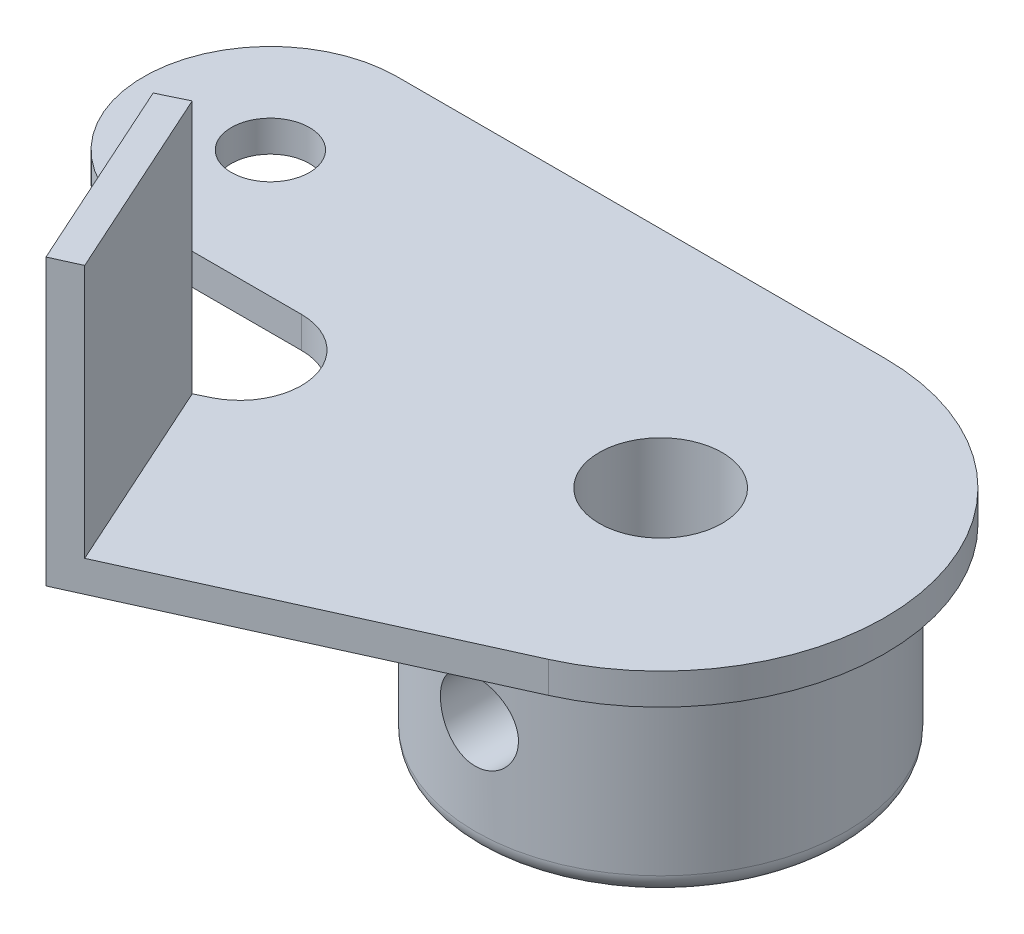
ISO-10303-21;
HEADER;
FILE_DESCRIPTION(('STEP AP214'),'2;1');
FILE_NAME('part.step','',(''),(''),'','','');
FILE_SCHEMA(('AUTOMOTIVE_DESIGN { 1 0 10303 214 1 1 1 1 }'));
ENDSEC;
DATA;
#1=APPLICATION_CONTEXT('core data for automotive mechanical design processes');
#2=APPLICATION_PROTOCOL_DEFINITION('international standard','automotive_design',2000,#1);
#3=PRODUCT_CONTEXT('',#1,'mechanical');
#4=PRODUCT('Part','Part','',(#3));
#5=PRODUCT_RELATED_PRODUCT_CATEGORY('part','',(#4));
#6=PRODUCT_DEFINITION_FORMATION('','',#4);
#7=PRODUCT_DEFINITION_CONTEXT('part definition',#1,'design');
#8=PRODUCT_DEFINITION('design','',#6,#7);
#9=PRODUCT_DEFINITION_SHAPE('','',#8);
#10=(LENGTH_UNIT() NAMED_UNIT(*) SI_UNIT(.MILLI.,.METRE.));
#11=(NAMED_UNIT(*) PLANE_ANGLE_UNIT() SI_UNIT($,.RADIAN.));
#12=(NAMED_UNIT(*) SI_UNIT($,.STERADIAN.) SOLID_ANGLE_UNIT());
#13=UNCERTAINTY_MEASURE_WITH_UNIT(LENGTH_MEASURE(1.E-05),#10,'distance_accuracy_value','');
#14=(GEOMETRIC_REPRESENTATION_CONTEXT(3) GLOBAL_UNCERTAINTY_ASSIGNED_CONTEXT((#13)) GLOBAL_UNIT_ASSIGNED_CONTEXT((#10,
#11,#12)) REPRESENTATION_CONTEXT('',''));
#15=CARTESIAN_POINT('',(0.,0.,0.));
#16=DIRECTION('',(0.,0.,1.));
#17=DIRECTION('',(1.,0.,0.));
#18=AXIS2_PLACEMENT_3D('',#15,#16,#17);
#19=CARTESIAN_POINT('',(0.,1.6,0.));
#20=DIRECTION('',(0.,-1.,0.));
#21=DIRECTION('',(0.,0.,-1.));
#22=AXIS2_PLACEMENT_3D('',#19,#20,#21);
#23=CYLINDRICAL_SURFACE('',#22,3.15);
#24=CARTESIAN_POINT('',(0.,-9.9,0.));
#25=DIRECTION('',(0.,1.,0.));
#26=DIRECTION('',(0.,0.,1.));
#27=AXIS2_PLACEMENT_3D('',#24,#25,#26);
#28=CIRCLE('',#27,3.15);
#29=CARTESIAN_POINT('',(0.,-9.9,3.15));
#30=VERTEX_POINT('',#29);
#31=EDGE_CURVE('E162',#30,#30,#28,.T.);
#32=ORIENTED_EDGE('',*,*,#31,.F.);
#33=EDGE_LOOP('',(#32));
#34=FACE_BOUND('',#33,.T.);
#35=CARTESIAN_POINT('',(0.,1.6,0.));
#36=DIRECTION('',(0.,1.,0.));
#37=DIRECTION('',(0.,0.,1.));
#38=AXIS2_PLACEMENT_3D('',#35,#36,#37);
#39=CIRCLE('',#38,3.15);
#40=CARTESIAN_POINT('',(0.,1.6,3.15));
#41=VERTEX_POINT('',#40);
#42=EDGE_CURVE('E170',#41,#41,#39,.T.);
#43=ORIENTED_EDGE('',*,*,#42,.T.);
#44=EDGE_LOOP('',(#43));
#45=FACE_BOUND('',#44,.T.);
#46=CARTESIAN_POINT('',(-2.,-4.,2.43361870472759));
#47=CARTESIAN_POINT('',(-1.99999048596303,-4.09897792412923,2.43363407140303));
#48=CARTESIAN_POINT('',(-1.99258494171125,-4.1980937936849,2.4397712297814));
#49=CARTESIAN_POINT('',(-1.96350941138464,-4.39293729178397,2.46321942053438));
#50=CARTESIAN_POINT('',(-1.94180331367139,-4.48865569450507,2.48055873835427));
#51=CARTESIAN_POINT('',(-1.88571217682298,-4.67329343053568,2.52345220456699));
#52=CARTESIAN_POINT('',(-1.851440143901,-4.76226508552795,2.5489328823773));
#53=CARTESIAN_POINT('',(-1.77151743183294,-4.93307511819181,2.60511197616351));
#54=CARTESIAN_POINT('',(-1.72586583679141,-5.01491292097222,2.6358108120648));
#55=CARTESIAN_POINT('',(-1.61708994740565,-5.18163300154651,2.70410628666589));
#56=CARTESIAN_POINT('',(-1.55241882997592,-5.26535664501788,2.74206853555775));
#57=CARTESIAN_POINT('',(-1.41059220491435,-5.42175437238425,2.81765858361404));
#58=CARTESIAN_POINT('',(-1.33342569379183,-5.49441860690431,2.85528605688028));
#59=CARTESIAN_POINT('',(-1.15704034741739,-5.63571807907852,2.93157022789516));
#60=CARTESIAN_POINT('',(-1.05626802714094,-5.70269215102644,2.96975927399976));
#61=CARTESIAN_POINT('',(-0.841996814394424,-5.81818709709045,3.03745228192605));
#62=CARTESIAN_POINT('',(-0.728511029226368,-5.86672675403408,3.0669650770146));
#63=CARTESIAN_POINT('',(-0.504499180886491,-5.9385134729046,3.11120961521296));
#64=CARTESIAN_POINT('',(-0.394895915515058,-5.96386827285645,3.12716069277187));
#65=CARTESIAN_POINT('',(-0.171964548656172,-5.99576167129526,3.14728504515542));
#66=CARTESIAN_POINT('',(-0.0586406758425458,-6.00232093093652,3.15147125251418));
#67=CARTESIAN_POINT('',(0.151552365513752,-5.99662936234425,3.1478620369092));
#68=CARTESIAN_POINT('',(0.248528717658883,-5.98685561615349,3.14164430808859));
#69=CARTESIAN_POINT('',(0.439138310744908,-5.95359030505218,3.12071260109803));
#70=CARTESIAN_POINT('',(0.532771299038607,-5.93009770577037,3.10599798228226));
#71=CARTESIAN_POINT('',(0.71448221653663,-5.87047576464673,3.06930433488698));
#72=CARTESIAN_POINT('',(0.802553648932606,-5.83433195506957,3.04731699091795));
#73=CARTESIAN_POINT('',(0.971433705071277,-5.75077179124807,2.9977610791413));
#74=CARTESIAN_POINT('',(1.05224075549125,-5.70335300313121,2.97019130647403));
#75=CARTESIAN_POINT('',(1.21525026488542,-5.5918894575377,2.90761365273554));
#76=CARTESIAN_POINT('',(1.29634063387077,-5.52650141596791,2.87210613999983));
#77=CARTESIAN_POINT('',(1.44710869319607,-5.3844238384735,2.79917994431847));
#78=CARTESIAN_POINT('',(1.51676911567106,-5.3077175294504,2.76175847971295));
#79=CARTESIAN_POINT('',(1.65238450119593,-5.13291104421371,2.68310715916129));
#80=CARTESIAN_POINT('',(1.71653615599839,-5.03331982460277,2.64205458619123));
#81=CARTESIAN_POINT('',(1.82699006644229,-4.82232618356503,2.56692053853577));
#82=CARTESIAN_POINT('',(1.87332485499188,-4.71094576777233,2.53282641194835));
#83=CARTESIAN_POINT('',(1.93594353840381,-4.50993207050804,2.48510313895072));
#84=CARTESIAN_POINT('',(1.95695691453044,-4.4224981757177,2.4684365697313));
#85=CARTESIAN_POINT('',(1.98705521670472,-4.24441139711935,2.44427838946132));
#86=CARTESIAN_POINT('',(1.99615746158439,-4.15376338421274,2.43677345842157));
#87=CARTESIAN_POINT('',(2.00187916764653,-3.97154888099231,2.43207683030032));
#88=CARTESIAN_POINT('',(1.99846473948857,-3.87998056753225,2.43491313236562));
#89=CARTESIAN_POINT('',(1.97931399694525,-3.69897745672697,2.45050151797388));
#90=CARTESIAN_POINT('',(1.96356738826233,-3.60954450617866,2.46326188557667));
#91=CARTESIAN_POINT('',(1.92117762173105,-3.43716644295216,2.4964515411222));
#92=CARTESIAN_POINT('',(1.89479801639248,-3.35411849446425,2.51669442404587));
#93=CARTESIAN_POINT('',(1.83219474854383,-3.19346113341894,2.56262885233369));
#94=CARTESIAN_POINT('',(1.79596764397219,-3.11585363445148,2.58832230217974));
#95=CARTESIAN_POINT('',(1.70664270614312,-2.95230993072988,2.64826132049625));
#96=CARTESIAN_POINT('',(1.65163646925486,-2.8676705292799,2.68319953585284));
#97=CARTESIAN_POINT('',(1.52987672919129,-2.70787617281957,2.75444460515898));
#98=CARTESIAN_POINT('',(1.46311080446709,-2.63273139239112,2.79075287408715));
#99=CARTESIAN_POINT('',(1.30608396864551,-2.48077221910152,2.86802362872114));
#100=CARTESIAN_POINT('',(1.21375656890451,-2.40592401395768,2.90870266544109));
#101=CARTESIAN_POINT('',(1.01546677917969,-2.27284680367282,2.98371307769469));
#102=CARTESIAN_POINT('',(0.909509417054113,-2.21461169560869,3.01804678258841));
#103=CARTESIAN_POINT('',(0.692269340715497,-2.12009871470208,3.07492813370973));
#104=CARTESIAN_POINT('',(0.581566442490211,-2.08282074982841,3.09800396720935));
#105=CARTESIAN_POINT('',(0.35364940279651,-2.02804419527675,3.13219438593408));
#106=CARTESIAN_POINT('',(0.236445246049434,-2.01051611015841,3.14332680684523));
#107=CARTESIAN_POINT('',(0.0184183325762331,-1.99757176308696,3.15154075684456));
#108=CARTESIAN_POINT('',(-0.0821686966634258,-1.99918404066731,3.15051062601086));
#109=CARTESIAN_POINT('',(-0.28141845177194,-2.01737468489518,3.13898890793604));
#110=CARTESIAN_POINT('',(-0.38008132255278,-2.03395192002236,3.12849803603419));
#111=CARTESIAN_POINT('',(-0.568457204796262,-2.08013872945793,3.09968712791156));
#112=CARTESIAN_POINT('',(-0.658372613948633,-2.10915783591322,3.08172279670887));
#113=CARTESIAN_POINT('',(-0.831943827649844,-2.17884042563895,3.03946637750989));
#114=CARTESIAN_POINT('',(-0.915598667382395,-2.21950569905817,3.01517331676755));
#115=CARTESIAN_POINT('',(-1.08344928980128,-2.31583060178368,2.95926218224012));
#116=CARTESIAN_POINT('',(-1.1668476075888,-2.37258931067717,2.92715228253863));
#117=CARTESIAN_POINT('',(-1.32350652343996,-2.4972131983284,2.85974121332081));
#118=CARTESIAN_POINT('',(-1.39675588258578,-2.56509051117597,2.82443657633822));
#119=CARTESIAN_POINT('',(-1.54245036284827,-2.72173939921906,2.74792336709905));
#120=CARTESIAN_POINT('',(-1.61312724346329,-2.81211786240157,2.70662345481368));
#121=CARTESIAN_POINT('',(-1.7386221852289,-3.00481645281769,2.62777208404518));
#122=CARTESIAN_POINT('',(-1.79344679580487,-3.10713162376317,2.59021908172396));
#123=CARTESIAN_POINT('',(-1.87534108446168,-3.29893211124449,2.53131778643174));
#124=CARTESIAN_POINT('',(-1.90584854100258,-3.38641034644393,2.50822135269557));
#125=CARTESIAN_POINT('',(-1.95462246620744,-3.5663246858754,2.47040933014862));
#126=CARTESIAN_POINT('',(-1.97292616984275,-3.65874477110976,2.45566826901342));
#127=CARTESIAN_POINT('',(-1.98972501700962,-3.79335049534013,2.44203397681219));
#128=CARTESIAN_POINT('',(-1.99357048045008,-3.83451094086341,2.43889105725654));
#129=CARTESIAN_POINT('',(-1.99871031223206,-3.91710614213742,2.43467992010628));
#130=CARTESIAN_POINT('',(-2.00000398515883,-3.95854096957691,2.43361226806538));
#131=CARTESIAN_POINT('',(-2.,-4.,2.43361870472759));
#132=B_SPLINE_CURVE_WITH_KNOTS('',3,(#46,#47,#48,#49,#50,#51,#52,#53,#54,#55,#56,#57,#58,#59,
#60,#61,#62,#63,#64,#65,#66,#67,#68,#69,#70,#71,#72,#73,#74,#75,#76,#77,#78,#79,#80,#81,#82,#83,
#84,#85,#86,#87,#88,#89,#90,#91,#92,#93,#94,#95,#96,#97,#98,#99,#100,#101,#102,#103,#104,#105,
#106,#107,#108,#109,#110,#111,#112,#113,#114,#115,#116,#117,#118,#119,#120,#121,#122,#123,#124,
#125,#126,#127,#128,#129,#130,#131),.UNSPECIFIED.,.T.,.F.,(4,2,2,2,2,2,2,2,2,2,2,2,2,2,2,2,2,2,
2,2,2,2,2,2,2,2,2,2,2,2,2,2,2,2,2,2,2,2,2,2,2,2,4),(0.,0.296743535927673,0.594239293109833,
0.889122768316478,1.18402998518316,1.51993870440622,1.85614485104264,2.23471138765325,
2.61289116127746,2.95168264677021,3.29010156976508,3.5816951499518,3.87331071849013,
4.16526086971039,4.45727410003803,4.78615817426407,5.11553462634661,5.48986491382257,
5.86350840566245,6.13674202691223,6.4095779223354,6.68315307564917,6.95695683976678,
7.22435474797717,7.49184624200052,7.81112947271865,8.13075200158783,8.50574828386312,
8.88060663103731,9.2355988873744,9.59006027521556,9.89031729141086,10.1905516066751,
10.4778877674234,10.7652681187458,11.0816516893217,11.398382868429,11.762616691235,
12.1266998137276,12.4120863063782,12.6965980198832,12.8208615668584,12.9451589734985),.UNSPECIFIED.);
#133=CARTESIAN_POINT('',(-2.,-4.,2.43361870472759));
#134=VERTEX_POINT('',#133);
#135=EDGE_CURVE('E154',#134,#134,#132,.T.);
#136=ORIENTED_EDGE('',*,*,#135,.T.);
#137=EDGE_LOOP('',(#136));
#138=FACE_BOUND('',#137,.T.);
#139=ADVANCED_FACE('F33',(#34,#45,#138),#23,.F.);
#140=CARTESIAN_POINT('',(0.,-9.9,0.));
#141=DIRECTION('',(0.,1.,0.));
#142=DIRECTION('',(0.,0.,1.));
#143=AXIS2_PLACEMENT_3D('',#140,#141,#142);
#144=CYLINDRICAL_SURFACE('',#143,9.5);
#145=CARTESIAN_POINT('',(0.,0.,0.));
#146=DIRECTION('',(0.,1.,0.));
#147=DIRECTION('',(0.,0.,1.));
#148=AXIS2_PLACEMENT_3D('',#145,#146,#147);
#149=CIRCLE('',#148,9.5);
#150=CARTESIAN_POINT('',(0.,0.,9.5));
#151=VERTEX_POINT('',#150);
#152=EDGE_CURVE('E165',#151,#151,#149,.T.);
#153=ORIENTED_EDGE('',*,*,#152,.F.);
#154=EDGE_LOOP('',(#153));
#155=FACE_BOUND('',#154,.T.);
#156=CARTESIAN_POINT('',(0.,-8.9,0.));
#157=DIRECTION('',(0.,1.,0.));
#158=DIRECTION('',(0.,0.,1.));
#159=AXIS2_PLACEMENT_3D('',#156,#157,#158);
#160=CIRCLE('',#159,9.5);
#161=CARTESIAN_POINT('',(0.,-8.9,9.5));
#162=VERTEX_POINT('',#161);
#163=EDGE_CURVE('E46',#162,#162,#160,.T.);
#164=ORIENTED_EDGE('',*,*,#163,.T.);
#165=EDGE_LOOP('',(#164));
#166=FACE_BOUND('',#165,.T.);
#167=CARTESIAN_POINT('',(0.,-6.,9.5));
#168=CARTESIAN_POINT('',(-0.111027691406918,-5.99999607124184,9.49999794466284));
#169=CARTESIAN_POINT('',(-0.222103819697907,-5.99072341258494,9.49803374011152));
#170=CARTESIAN_POINT('',(-0.441107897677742,-5.95391221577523,9.49038773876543));
#171=CARTESIAN_POINT('',(-0.549033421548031,-5.92635997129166,9.48470315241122));
#172=CARTESIAN_POINT('',(-0.758538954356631,-5.85388532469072,9.47025014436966));
#173=CARTESIAN_POINT('',(-0.860125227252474,-5.80898039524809,9.46148482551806));
#174=CARTESIAN_POINT('',(-1.05431669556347,-5.70312896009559,9.44181943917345));
#175=CARTESIAN_POINT('',(-1.14692225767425,-5.64218310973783,9.43091945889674));
#176=CARTESIAN_POINT('',(-1.32191105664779,-5.5050163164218,9.40799939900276));
#177=CARTESIAN_POINT('',(-1.40414098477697,-5.42860195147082,9.39596628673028));
#178=CARTESIAN_POINT('',(-1.5547158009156,-5.26308274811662,9.37222932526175));
#179=CARTESIAN_POINT('',(-1.62305952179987,-5.17397684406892,9.36052550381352));
#180=CARTESIAN_POINT('',(-1.74458761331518,-4.98448418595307,9.33864435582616));
#181=CARTESIAN_POINT('',(-1.79761077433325,-4.88399193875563,9.3284837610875));
#182=CARTESIAN_POINT('',(-1.88595912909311,-4.67527480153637,9.31102569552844));
#183=CARTESIAN_POINT('',(-1.92128627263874,-4.56705076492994,9.30372790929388));
#184=CARTESIAN_POINT('',(-1.97273711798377,-4.34759918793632,9.29295410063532));
#185=CARTESIAN_POINT('',(-1.98913117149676,-4.23643772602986,9.28942433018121));
#186=CARTESIAN_POINT('',(-2.00309070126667,-4.01289040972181,9.28642462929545));
#187=CARTESIAN_POINT('',(-2.0006583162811,-3.90050469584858,9.28695423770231));
#188=CARTESIAN_POINT('',(-1.97725203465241,-3.67969454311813,9.29196471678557));
#189=CARTESIAN_POINT('',(-1.95659032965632,-3.57123527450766,9.29637905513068));
#190=CARTESIAN_POINT('',(-1.89780570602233,-3.35935778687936,9.30855661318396));
#191=CARTESIAN_POINT('',(-1.85968187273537,-3.25593983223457,9.31632000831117));
#192=CARTESIAN_POINT('',(-1.76676342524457,-3.05619311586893,9.3343876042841));
#193=CARTESIAN_POINT('',(-1.71184711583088,-2.95992270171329,9.34471024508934));
#194=CARTESIAN_POINT('',(-1.58698828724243,-2.77784720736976,9.36672168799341));
#195=CARTESIAN_POINT('',(-1.51704386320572,-2.6920434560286,9.37841066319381));
#196=CARTESIAN_POINT('',(-1.36245319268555,-2.5315377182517,9.40212443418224));
#197=CARTESIAN_POINT('',(-1.27754103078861,-2.45709191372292,9.41415127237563));
#198=CARTESIAN_POINT('',(-1.09630350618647,-2.32345749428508,9.43697235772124));
#199=CARTESIAN_POINT('',(-0.999977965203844,-2.26426911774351,9.44776658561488));
#200=CARTESIAN_POINT('',(-0.798347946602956,-2.16277357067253,9.4669373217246));
#201=CARTESIAN_POINT('',(-0.693027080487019,-2.12049804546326,9.47530928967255));
#202=CARTESIAN_POINT('',(-0.476561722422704,-2.05431411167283,9.48865817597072));
#203=CARTESIAN_POINT('',(-0.36541801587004,-2.0304032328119,9.49363555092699));
#204=CARTESIAN_POINT('',(-0.142661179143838,-2.00199549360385,9.49957007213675));
#205=CARTESIAN_POINT('',(-0.0310945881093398,-1.9971484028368,9.50059973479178));
#206=CARTESIAN_POINT('',(0.191254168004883,-2.00605926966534,9.49872522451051));
#207=CARTESIAN_POINT('',(0.302036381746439,-2.01981606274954,9.49582129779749));
#208=CARTESIAN_POINT('',(0.518524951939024,-2.06525350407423,9.48645148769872));
#209=CARTESIAN_POINT('',(0.624271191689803,-2.0967522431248,9.48002177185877));
#210=CARTESIAN_POINT('',(0.828980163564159,-2.17657893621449,9.46431934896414));
#211=CARTESIAN_POINT('',(0.927942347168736,-2.22490824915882,9.45504641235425));
#212=CARTESIAN_POINT('',(1.1177352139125,-2.33776641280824,9.43450639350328));
#213=CARTESIAN_POINT('',(1.20843942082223,-2.40250330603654,9.42321429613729));
#214=CARTESIAN_POINT('',(1.3778228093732,-2.5460629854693,9.39994292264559));
#215=CARTESIAN_POINT('',(1.45650054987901,-2.62488745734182,9.38796356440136));
#216=CARTESIAN_POINT('',(1.60096761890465,-2.7959863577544,9.36442002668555));
#217=CARTESIAN_POINT('',(1.66651533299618,-2.88846649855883,9.35286635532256));
#218=CARTESIAN_POINT('',(1.78114871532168,-3.08332921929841,9.3317158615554));
#219=CARTESIAN_POINT('',(1.83023507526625,-3.1857113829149,9.32211895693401));
#220=CARTESIAN_POINT('',(1.91023404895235,-3.39693504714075,9.30605568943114));
#221=CARTESIAN_POINT('',(1.94124569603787,-3.50573768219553,9.29957230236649));
#222=CARTESIAN_POINT('',(1.98450997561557,-3.72716231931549,9.29043690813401));
#223=CARTESIAN_POINT('',(1.99676535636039,-3.83978375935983,9.2877843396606));
#224=CARTESIAN_POINT('',(2.00205901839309,-4.06321772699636,9.28664441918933));
#225=CARTESIAN_POINT('',(1.99547977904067,-4.17402094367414,9.28807416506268));
#226=CARTESIAN_POINT('',(1.96414112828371,-4.39290256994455,9.29475130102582));
#227=CARTESIAN_POINT('',(1.93938189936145,-4.50098100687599,9.29999865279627));
#228=CARTESIAN_POINT('',(1.87256463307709,-4.71106838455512,9.31368082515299));
#229=CARTESIAN_POINT('',(1.83055834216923,-4.81309444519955,9.32210610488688));
#230=CARTESIAN_POINT('',(1.7304853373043,-5.00870903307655,9.34119928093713));
#231=CARTESIAN_POINT('',(1.67241709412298,-5.10229675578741,9.35186739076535));
#232=CARTESIAN_POINT('',(1.54058300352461,-5.28027215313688,9.37449454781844));
#233=CARTESIAN_POINT('',(1.46654292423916,-5.36445412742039,9.38647407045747));
#234=CARTESIAN_POINT('',(1.30542742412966,-5.51932471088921,9.41023256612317));
#235=CARTESIAN_POINT('',(1.21834900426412,-5.59001020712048,9.42201149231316));
#236=CARTESIAN_POINT('',(1.0323889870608,-5.71667699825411,9.44420645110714));
#237=CARTESIAN_POINT('',(0.933379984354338,-5.77247451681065,9.45460471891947));
#238=CARTESIAN_POINT('',(0.727194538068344,-5.86654901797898,9.47269018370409));
#239=CARTESIAN_POINT('',(0.620025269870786,-5.90484119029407,9.48037972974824));
#240=CARTESIAN_POINT('',(0.427239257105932,-5.95572669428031,9.49075437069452));
#241=CARTESIAN_POINT('',(0.34269090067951,-5.97229845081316,9.4942005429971));
#242=CARTESIAN_POINT('',(0.172104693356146,-5.99443641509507,9.49882411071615));
#243=CARTESIAN_POINT('',(0.0860668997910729,-6.00000304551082,9.50000159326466));
#244=CARTESIAN_POINT('',(0.,-6.,9.5));
#245=B_SPLINE_CURVE_WITH_KNOTS('',3,(#167,#168,#169,#170,#171,#172,#173,#174,#175,#176,#177,
#178,#179,#180,#181,#182,#183,#184,#185,#186,#187,#188,#189,#190,#191,#192,#193,#194,#195,#196,
#197,#198,#199,#200,#201,#202,#203,#204,#205,#206,#207,#208,#209,#210,#211,#212,#213,#214,#215,
#216,#217,#218,#219,#220,#221,#222,#223,#224,#225,#226,#227,#228,#229,#230,#231,#232,#233,#234,
#235,#236,#237,#238,#239,#240,#241,#242,#243,#244),.UNSPECIFIED.,.T.,.F.,(4,2,2,2,2,2,2,2,2,2,2,
2,2,2,2,2,2,2,2,2,2,2,2,2,2,2,2,2,2,2,2,2,2,2,2,2,2,2,4),(0.,0.332768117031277,
0.665786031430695,0.998469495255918,1.33113936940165,1.6682591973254,2.00540734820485,
2.34598369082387,2.68652249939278,3.02213605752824,3.35771148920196,3.68764911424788,
4.01760402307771,4.35000918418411,4.68245650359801,5.02154876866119,5.36064633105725,
5.70037543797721,6.04005883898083,6.37347176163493,6.7068638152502,7.03689822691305,
7.36695929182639,7.70143535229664,8.03595146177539,8.37614947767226,8.71633319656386,
9.05463505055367,9.39288733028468,9.72431965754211,10.0557486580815,10.3861904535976,
10.7166637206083,11.0533410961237,11.3900960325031,11.7308334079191,12.0712745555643,
12.329241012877,12.5871975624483),.UNSPECIFIED.);
#246=CARTESIAN_POINT('',(0.,-6.,9.5));
#247=VERTEX_POINT('',#246);
#248=EDGE_CURVE('E37',#247,#247,#245,.T.);
#249=ORIENTED_EDGE('',*,*,#248,.T.);
#250=EDGE_LOOP('',(#249));
#251=FACE_BOUND('',#250,.T.);
#252=ADVANCED_FACE('F199',(#155,#166,#251),#144,.T.);
#253=CARTESIAN_POINT('',(0.,1.6,0.));
#254=DIRECTION('',(0.,1.,0.));
#255=DIRECTION('',(0.,0.,1.));
#256=AXIS2_PLACEMENT_3D('',#253,#254,#255);
#257=PLANE('',#256);
#258=DIRECTION('',(-0.412042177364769,0.,-0.911164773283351));
#259=VECTOR('',#258,1.);
#260=CARTESIAN_POINT('',(-16.1820359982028,1.6,7.82423700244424));
#261=LINE('',#260,#259);
#262=CARTESIAN_POINT('',(-11.6337033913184,1.6,17.8821404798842));
#263=VERTEX_POINT('',#262);
#264=CARTESIAN_POINT('',(-16.1820359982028,1.6,7.82423700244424));
#265=VERTEX_POINT('',#264);
#266=EDGE_CURVE('E54',#263,#265,#261,.T.);
#267=ORIENTED_EDGE('',*,*,#266,.F.);
#268=DIRECTION('',(0.911164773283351,0.,-0.412042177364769));
#269=VECTOR('',#268,1.);
#270=CARTESIAN_POINT('',(4.73848503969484,1.6,10.4783948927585));
#271=LINE('',#270,#269);
#272=CARTESIAN_POINT('',(4.73848503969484,1.6,10.4783948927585));
#273=VERTEX_POINT('',#272);
#274=EDGE_CURVE('E59',#263,#273,#271,.T.);
#275=ORIENTED_EDGE('',*,*,#274,.T.);
#276=CARTESIAN_POINT('',(0.,1.6,0.));
#277=DIRECTION('',(0.,1.,0.));
#278=DIRECTION('',(0.,0.,1.));
#279=AXIS2_PLACEMENT_3D('',#276,#277,#278);
#280=CIRCLE('',#279,11.5);
#281=CARTESIAN_POINT('',(0.,1.6,-11.5));
#282=VERTEX_POINT('',#281);
#283=EDGE_CURVE('E177',#273,#282,#280,.T.);
#284=ORIENTED_EDGE('',*,*,#283,.T.);
#285=DIRECTION('',(-1.,0.,0.));
#286=VECTOR('',#285,1.);
#287=CARTESIAN_POINT('',(0.,1.6,-11.5));
#288=LINE('',#287,#286);
#289=CARTESIAN_POINT('',(-25.,1.6,-11.5));
#290=VERTEX_POINT('',#289);
#291=EDGE_CURVE('E102',#282,#290,#288,.T.);
#292=ORIENTED_EDGE('',*,*,#291,.T.);
#293=CARTESIAN_POINT('',(-25.,1.6,-4.99999999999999));
#294=DIRECTION('',(0.,1.,0.));
#295=DIRECTION('',(0.,0.,1.));
#296=AXIS2_PLACEMENT_3D('',#293,#294,#295);
#297=CIRCLE('',#296,6.50000000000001);
#298=CARTESIAN_POINT('',(-25.,1.6,1.50000000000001));
#299=VERTEX_POINT('',#298);
#300=EDGE_CURVE('E120',#290,#299,#297,.T.);
#301=ORIENTED_EDGE('',*,*,#300,.T.);
#302=DIRECTION('',(1.,0.,0.));
#303=VECTOR('',#302,1.);
#304=CARTESIAN_POINT('',(-25.,1.6,1.50000000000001));
#305=LINE('',#304,#303);
#306=CARTESIAN_POINT('',(-16.9092175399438,1.6,1.50000000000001));
#307=VERTEX_POINT('',#306);
#308=EDGE_CURVE('E112',#299,#307,#305,.T.);
#309=ORIENTED_EDGE('',*,*,#308,.T.);
#310=CARTESIAN_POINT('',(-16.9092175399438,1.6,4.66276717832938));
#311=DIRECTION('',(0.,-1.,0.));
#312=DIRECTION('',(0.,0.,-1.));
#313=AXIS2_PLACEMENT_3D('',#310,#311,#312);
#314=CIRCLE('',#313,3.16276717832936);
#315=CARTESIAN_POINT('',(-15.5324639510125,1.6,7.51015998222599));
#316=VERTEX_POINT('',#315);
#317=EDGE_CURVE('E117',#307,#316,#314,.T.);
#318=ORIENTED_EDGE('',*,*,#317,.T.);
#319=DIRECTION('',(-0.90028530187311,0.,0.435300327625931));
#320=VECTOR('',#319,1.);
#321=CARTESIAN_POINT('',(-15.5324639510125,1.6,7.51015998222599));
#322=LINE('',#321,#320);
#323=EDGE_CURVE('E138',#316,#265,#322,.T.);
#324=ORIENTED_EDGE('',*,*,#323,.T.);
#325=EDGE_LOOP('',(#267,#275,#284,#292,#301,#309,#318,#324));
#326=FACE_BOUND('',#325,.T.);
#327=CARTESIAN_POINT('',(-25.,1.6,-4.99999999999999));
#328=DIRECTION('',(0.,1.,0.));
#329=DIRECTION('',(0.,0.,1.));
#330=AXIS2_PLACEMENT_3D('',#327,#328,#329);
#331=CIRCLE('',#330,2.);
#332=CARTESIAN_POINT('',(-25.,1.6,-2.99999999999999));
#333=VERTEX_POINT('',#332);
#334=EDGE_CURVE('E167',#333,#333,#331,.T.);
#335=ORIENTED_EDGE('',*,*,#334,.F.);
#336=EDGE_LOOP('',(#335));
#337=FACE_BOUND('',#336,.T.);
#338=ORIENTED_EDGE('',*,*,#42,.F.);
#339=EDGE_LOOP('',(#338));
#340=FACE_BOUND('',#339,.T.);
#341=ADVANCED_FACE('F114',(#326,#337,#340),#257,.T.);
#342=CARTESIAN_POINT('',(0.,0.,0.));
#343=DIRECTION('',(0.,1.,0.));
#344=DIRECTION('',(0.,0.,1.));
#345=AXIS2_PLACEMENT_3D('',#342,#343,#344);
#346=PLANE('',#345);
#347=ORIENTED_EDGE('',*,*,#152,.T.);
#348=EDGE_LOOP('',(#347));
#349=FACE_BOUND('',#348,.T.);
#350=CARTESIAN_POINT('',(0.,0.,0.));
#351=DIRECTION('',(0.,1.,0.));
#352=DIRECTION('',(0.,0.,1.));
#353=AXIS2_PLACEMENT_3D('',#350,#351,#352);
#354=CIRCLE('',#353,11.5);
#355=CARTESIAN_POINT('',(4.73848503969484,0.,10.4783948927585));
#356=VERTEX_POINT('',#355);
#357=CARTESIAN_POINT('',(0.,0.,-11.5));
#358=VERTEX_POINT('',#357);
#359=EDGE_CURVE('E176',#356,#358,#354,.T.);
#360=ORIENTED_EDGE('',*,*,#359,.F.);
#361=DIRECTION('',(0.911164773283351,0.,-0.412042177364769));
#362=VECTOR('',#361,1.);
#363=CARTESIAN_POINT('',(4.73848503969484,0.,10.4783948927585));
#364=LINE('',#363,#362);
#365=CARTESIAN_POINT('',(-13.,0.,18.5));
#366=VERTEX_POINT('',#365);
#367=EDGE_CURVE('E93',#366,#356,#364,.T.);
#368=ORIENTED_EDGE('',*,*,#367,.F.);
#369=DIRECTION('',(0.412042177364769,0.,0.911164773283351));
#370=VECTOR('',#369,1.);
#371=CARTESIAN_POINT('',(-17.5324639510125,0.,8.47718749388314));
#372=LINE('',#371,#370);
#373=CARTESIAN_POINT('',(-17.5324639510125,0.,8.47718749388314));
#374=VERTEX_POINT('',#373);
#375=EDGE_CURVE('E279',#374,#366,#372,.T.);
#376=ORIENTED_EDGE('',*,*,#375,.F.);
#377=DIRECTION('',(-0.90028530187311,0.,0.435300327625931));
#378=VECTOR('',#377,1.);
#379=CARTESIAN_POINT('',(-15.5324639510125,0.,7.51015998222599));
#380=LINE('',#379,#378);
#381=CARTESIAN_POINT('',(-15.5324639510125,0.,7.51015998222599));
#382=VERTEX_POINT('',#381);
#383=EDGE_CURVE('E287',#382,#374,#380,.T.);
#384=ORIENTED_EDGE('',*,*,#383,.F.);
#385=CARTESIAN_POINT('',(-16.9092175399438,0.,4.66276717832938));
#386=DIRECTION('',(0.,-1.,0.));
#387=DIRECTION('',(0.,0.,-1.));
#388=AXIS2_PLACEMENT_3D('',#385,#386,#387);
#389=CIRCLE('',#388,3.16276717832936);
#390=CARTESIAN_POINT('',(-16.9092175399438,0.,1.50000000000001));
#391=VERTEX_POINT('',#390);
#392=EDGE_CURVE('E292',#391,#382,#389,.T.);
#393=ORIENTED_EDGE('',*,*,#392,.F.);
#394=DIRECTION('',(1.,0.,0.));
#395=VECTOR('',#394,1.);
#396=CARTESIAN_POINT('',(-25.,0.,1.50000000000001));
#397=LINE('',#396,#395);
#398=CARTESIAN_POINT('',(-25.,0.,1.50000000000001));
#399=VERTEX_POINT('',#398);
#400=EDGE_CURVE('E129',#399,#391,#397,.T.);
#401=ORIENTED_EDGE('',*,*,#400,.F.);
#402=CARTESIAN_POINT('',(-25.,0.,-4.99999999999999));
#403=DIRECTION('',(0.,1.,0.));
#404=DIRECTION('',(0.,0.,1.));
#405=AXIS2_PLACEMENT_3D('',#402,#403,#404);
#406=CIRCLE('',#405,6.50000000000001);
#407=CARTESIAN_POINT('',(-25.,0.,-11.5));
#408=VERTEX_POINT('',#407);
#409=EDGE_CURVE('E190',#408,#399,#406,.T.);
#410=ORIENTED_EDGE('',*,*,#409,.F.);
#411=DIRECTION('',(-1.,0.,0.));
#412=VECTOR('',#411,1.);
#413=CARTESIAN_POINT('',(0.,0.,-11.5));
#414=LINE('',#413,#412);
#415=EDGE_CURVE('E184',#358,#408,#414,.T.);
#416=ORIENTED_EDGE('',*,*,#415,.F.);
#417=EDGE_LOOP('',(#360,#368,#376,#384,#393,#401,#410,#416));
#418=FACE_BOUND('',#417,.T.);
#419=CARTESIAN_POINT('',(-25.,0.,-4.99999999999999));
#420=DIRECTION('',(0.,1.,0.));
#421=DIRECTION('',(0.,0.,1.));
#422=AXIS2_PLACEMENT_3D('',#419,#420,#421);
#423=CIRCLE('',#422,2.);
#424=CARTESIAN_POINT('',(-25.,0.,-2.99999999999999));
#425=VERTEX_POINT('',#424);
#426=EDGE_CURVE('E171',#425,#425,#423,.T.);
#427=ORIENTED_EDGE('',*,*,#426,.T.);
#428=EDGE_LOOP('',(#427));
#429=FACE_BOUND('',#428,.T.);
#430=ADVANCED_FACE('F290',(#349,#418,#429),#346,.F.);
#431=CARTESIAN_POINT('',(0.,1.6,0.));
#432=DIRECTION('',(0.,-1.,0.));
#433=DIRECTION('',(0.,0.,-1.));
#434=AXIS2_PLACEMENT_3D('',#431,#432,#433);
#435=CYLINDRICAL_SURFACE('',#434,11.5);
#436=ORIENTED_EDGE('',*,*,#359,.T.);
#437=DIRECTION('',(0.,-1.,0.));
#438=VECTOR('',#437,1.);
#439=CARTESIAN_POINT('',(0.,1.6,-11.5));
#440=LINE('',#439,#438);
#441=EDGE_CURVE('E187',#282,#358,#440,.T.);
#442=ORIENTED_EDGE('',*,*,#441,.F.);
#443=ORIENTED_EDGE('',*,*,#283,.F.);
#444=DIRECTION('',(0.,-1.,0.));
#445=VECTOR('',#444,1.);
#446=CARTESIAN_POINT('',(4.73848503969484,1.6,10.4783948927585));
#447=LINE('',#446,#445);
#448=EDGE_CURVE('E150',#273,#356,#447,.T.);
#449=ORIENTED_EDGE('',*,*,#448,.T.);
#450=EDGE_LOOP('',(#436,#442,#443,#449));
#451=FACE_BOUND('',#450,.T.);
#452=ADVANCED_FACE('F301',(#451),#435,.T.);
#453=CARTESIAN_POINT('',(0.,1.6,-11.5));
#454=DIRECTION('',(0.,0.,1.));
#455=DIRECTION('',(1.,0.,0.));
#456=AXIS2_PLACEMENT_3D('',#453,#454,#455);
#457=PLANE('',#456);
#458=ORIENTED_EDGE('',*,*,#415,.T.);
#459=DIRECTION('',(0.,-1.,0.));
#460=VECTOR('',#459,1.);
#461=CARTESIAN_POINT('',(-25.,1.6,-11.5));
#462=LINE('',#461,#460);
#463=EDGE_CURVE('E182',#290,#408,#462,.T.);
#464=ORIENTED_EDGE('',*,*,#463,.F.);
#465=ORIENTED_EDGE('',*,*,#291,.F.);
#466=ORIENTED_EDGE('',*,*,#441,.T.);
#467=EDGE_LOOP('',(#458,#464,#465,#466));
#468=FACE_BOUND('',#467,.T.);
#469=ADVANCED_FACE('F183',(#468),#457,.F.);
#470=CARTESIAN_POINT('',(-25.,1.6,-4.99999999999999));
#471=DIRECTION('',(0.,-1.,0.));
#472=DIRECTION('',(0.,0.,-1.));
#473=AXIS2_PLACEMENT_3D('',#470,#471,#472);
#474=CYLINDRICAL_SURFACE('',#473,6.50000000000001);
#475=ORIENTED_EDGE('',*,*,#409,.T.);
#476=DIRECTION('',(0.,-1.,0.));
#477=VECTOR('',#476,1.);
#478=CARTESIAN_POINT('',(-25.,1.6,1.50000000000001));
#479=LINE('',#478,#477);
#480=EDGE_CURVE('E132',#299,#399,#479,.T.);
#481=ORIENTED_EDGE('',*,*,#480,.F.);
#482=ORIENTED_EDGE('',*,*,#300,.F.);
#483=ORIENTED_EDGE('',*,*,#463,.T.);
#484=EDGE_LOOP('',(#475,#481,#482,#483));
#485=FACE_BOUND('',#484,.T.);
#486=ADVANCED_FACE('F189',(#485),#474,.T.);
#487=CARTESIAN_POINT('',(-25.,1.6,1.50000000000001));
#488=DIRECTION('',(0.,0.,-1.));
#489=DIRECTION('',(-1.,0.,0.));
#490=AXIS2_PLACEMENT_3D('',#487,#488,#489);
#491=PLANE('',#490);
#492=ORIENTED_EDGE('',*,*,#400,.T.);
#493=DIRECTION('',(0.,-1.,0.));
#494=VECTOR('',#493,1.);
#495=CARTESIAN_POINT('',(-16.9092175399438,1.6,1.50000000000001));
#496=LINE('',#495,#494);
#497=EDGE_CURVE('E126',#307,#391,#496,.T.);
#498=ORIENTED_EDGE('',*,*,#497,.F.);
#499=ORIENTED_EDGE('',*,*,#308,.F.);
#500=ORIENTED_EDGE('',*,*,#480,.T.);
#501=EDGE_LOOP('',(#492,#498,#499,#500));
#502=FACE_BOUND('',#501,.T.);
#503=ADVANCED_FACE('F127',(#502),#491,.F.);
#504=CARTESIAN_POINT('',(-16.9092175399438,1.6,4.66276717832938));
#505=DIRECTION('',(0.,-1.,0.));
#506=DIRECTION('',(0.,0.,-1.));
#507=AXIS2_PLACEMENT_3D('',#504,#505,#506);
#508=CYLINDRICAL_SURFACE('',#507,3.16276717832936);
#509=ORIENTED_EDGE('',*,*,#392,.T.);
#510=DIRECTION('',(0.,-1.,0.));
#511=VECTOR('',#510,1.);
#512=CARTESIAN_POINT('',(-15.5324639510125,1.6,7.51015998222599));
#513=LINE('',#512,#511);
#514=EDGE_CURVE('E133',#316,#382,#513,.T.);
#515=ORIENTED_EDGE('',*,*,#514,.F.);
#516=ORIENTED_EDGE('',*,*,#317,.F.);
#517=ORIENTED_EDGE('',*,*,#497,.T.);
#518=EDGE_LOOP('',(#509,#515,#516,#517));
#519=FACE_BOUND('',#518,.T.);
#520=ADVANCED_FACE('F135',(#519),#508,.F.);
#521=CARTESIAN_POINT('',(-15.5324639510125,1.6,7.51015998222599));
#522=DIRECTION('',(0.435300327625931,0.,0.90028530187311));
#523=DIRECTION('',(0.90028530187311,0.,-0.435300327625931));
#524=AXIS2_PLACEMENT_3D('',#521,#522,#523);
#525=PLANE('',#524);
#526=ORIENTED_EDGE('',*,*,#383,.T.);
#527=DIRECTION('',(0.,-1.,0.));
#528=VECTOR('',#527,1.);
#529=CARTESIAN_POINT('',(-17.5324639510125,1.6,8.47718749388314));
#530=LINE('',#529,#528);
#531=CARTESIAN_POINT('',(-17.5324639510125,14.6,8.47718749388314));
#532=VERTEX_POINT('',#531);
#533=EDGE_CURVE('E280',#532,#374,#530,.T.);
#534=ORIENTED_EDGE('',*,*,#533,.F.);
#535=DIRECTION('',(-0.90028530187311,0.,0.435300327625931));
#536=VECTOR('',#535,1.);
#537=CARTESIAN_POINT('',(-16.1820359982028,14.6,7.82423700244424));
#538=LINE('',#537,#536);
#539=CARTESIAN_POINT('',(-16.1820359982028,14.6,7.82423700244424));
#540=VERTEX_POINT('',#539);
#541=EDGE_CURVE('E153',#540,#532,#538,.T.);
#542=ORIENTED_EDGE('',*,*,#541,.F.);
#543=DIRECTION('',(0.,-1.,0.));
#544=VECTOR('',#543,1.);
#545=CARTESIAN_POINT('',(-16.1820359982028,14.6,7.82423700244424));
#546=LINE('',#545,#544);
#547=EDGE_CURVE('E155',#540,#265,#546,.T.);
#548=ORIENTED_EDGE('',*,*,#547,.T.);
#549=ORIENTED_EDGE('',*,*,#323,.F.);
#550=ORIENTED_EDGE('',*,*,#514,.T.);
#551=EDGE_LOOP('',(#526,#534,#542,#548,#549,#550));
#552=FACE_BOUND('',#551,.T.);
#553=ADVANCED_FACE('F286',(#552),#525,.F.);
#554=CARTESIAN_POINT('',(-17.5324639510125,1.6,8.47718749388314));
#555=DIRECTION('',(0.911164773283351,0.,-0.412042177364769));
#556=DIRECTION('',(-0.412042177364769,0.,-0.911164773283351));
#557=AXIS2_PLACEMENT_3D('',#554,#555,#556);
#558=PLANE('',#557);
#559=ORIENTED_EDGE('',*,*,#375,.T.);
#560=DIRECTION('',(0.,-1.,0.));
#561=VECTOR('',#560,1.);
#562=CARTESIAN_POINT('',(-13.,1.6,18.5));
#563=LINE('',#562,#561);
#564=CARTESIAN_POINT('',(-13.,14.6,18.5));
#565=VERTEX_POINT('',#564);
#566=EDGE_CURVE('E275',#565,#366,#563,.T.);
#567=ORIENTED_EDGE('',*,*,#566,.F.);
#568=DIRECTION('',(0.412042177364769,0.,0.911164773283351));
#569=VECTOR('',#568,1.);
#570=CARTESIAN_POINT('',(-17.5324639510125,14.6,8.47718749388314));
#571=LINE('',#570,#569);
#572=EDGE_CURVE('E255',#532,#565,#571,.T.);
#573=ORIENTED_EDGE('',*,*,#572,.F.);
#574=ORIENTED_EDGE('',*,*,#533,.T.);
#575=EDGE_LOOP('',(#559,#567,#573,#574));
#576=FACE_BOUND('',#575,.T.);
#577=ADVANCED_FACE('F276',(#576),#558,.F.);
#578=CARTESIAN_POINT('',(4.73848503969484,1.6,10.4783948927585));
#579=DIRECTION('',(-0.412042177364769,0.,-0.911164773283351));
#580=DIRECTION('',(-0.911164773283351,0.,0.412042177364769));
#581=AXIS2_PLACEMENT_3D('',#578,#579,#580);
#582=PLANE('',#581);
#583=ORIENTED_EDGE('',*,*,#367,.T.);
#584=ORIENTED_EDGE('',*,*,#448,.F.);
#585=ORIENTED_EDGE('',*,*,#274,.F.);
#586=DIRECTION('',(0.,-1.,0.));
#587=VECTOR('',#586,1.);
#588=CARTESIAN_POINT('',(-11.6337033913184,14.6,17.8821404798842));
#589=LINE('',#588,#587);
#590=CARTESIAN_POINT('',(-11.6337033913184,14.6,17.8821404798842));
#591=VERTEX_POINT('',#590);
#592=EDGE_CURVE('E166',#591,#263,#589,.T.);
#593=ORIENTED_EDGE('',*,*,#592,.F.);
#594=DIRECTION('',(0.911164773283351,0.,-0.412042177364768));
#595=VECTOR('',#594,1.);
#596=CARTESIAN_POINT('',(-13.,14.6,18.5));
#597=LINE('',#596,#595);
#598=EDGE_CURVE('E263',#565,#591,#597,.T.);
#599=ORIENTED_EDGE('',*,*,#598,.F.);
#600=ORIENTED_EDGE('',*,*,#566,.T.);
#601=EDGE_LOOP('',(#583,#584,#585,#593,#599,#600));
#602=FACE_BOUND('',#601,.T.);
#603=ADVANCED_FACE('F270',(#602),#582,.F.);
#604=CARTESIAN_POINT('',(-25.,1.6,-4.99999999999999));
#605=DIRECTION('',(0.,-1.,0.));
#606=DIRECTION('',(0.,0.,-1.));
#607=AXIS2_PLACEMENT_3D('',#604,#605,#606);
#608=CYLINDRICAL_SURFACE('',#607,2.);
#609=ORIENTED_EDGE('',*,*,#334,.T.);
#610=EDGE_LOOP('',(#609));
#611=FACE_BOUND('',#610,.T.);
#612=ORIENTED_EDGE('',*,*,#426,.F.);
#613=EDGE_LOOP('',(#612));
#614=FACE_BOUND('',#613,.T.);
#615=ADVANCED_FACE('F213',(#611,#614),#608,.F.);
#616=CARTESIAN_POINT('',(0.,-9.9,0.));
#617=DIRECTION('',(0.,1.,0.));
#618=DIRECTION('',(0.,0.,1.));
#619=AXIS2_PLACEMENT_3D('',#616,#617,#618);
#620=PLANE('',#619);
#621=CARTESIAN_POINT('',(0.,-9.9,0.));
#622=DIRECTION('',(0.,1.,0.));
#623=DIRECTION('',(0.,0.,1.));
#624=AXIS2_PLACEMENT_3D('',#621,#622,#623);
#625=CIRCLE('',#624,8.5);
#626=CARTESIAN_POINT('',(0.,-9.9,8.5));
#627=VERTEX_POINT('',#626);
#628=EDGE_CURVE('E11',#627,#627,#625,.F.);
#629=ORIENTED_EDGE('',*,*,#628,.T.);
#630=EDGE_LOOP('',(#629));
#631=FACE_BOUND('',#630,.T.);
#632=ORIENTED_EDGE('',*,*,#31,.T.);
#633=EDGE_LOOP('',(#632));
#634=FACE_BOUND('',#633,.T.);
#635=ADVANCED_FACE('F204',(#631,#634),#620,.F.);
#636=CARTESIAN_POINT('',(0.,-8.9,0.));
#637=DIRECTION('',(0.,1.,0.));
#638=DIRECTION('',(0.,0.,1.));
#639=AXIS2_PLACEMENT_3D('',#636,#637,#638);
#640=TOROIDAL_SURFACE('',#639,8.5,1.);
#641=ORIENTED_EDGE('',*,*,#628,.F.);
#642=EDGE_LOOP('',(#641));
#643=FACE_BOUND('',#642,.T.);
#644=ORIENTED_EDGE('',*,*,#163,.F.);
#645=EDGE_LOOP('',(#644));
#646=FACE_BOUND('',#645,.T.);
#647=ADVANCED_FACE('F35',(#643,#646),#640,.T.);
#648=CARTESIAN_POINT('',(-16.1820359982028,14.6,7.82423700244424));
#649=DIRECTION('',(-0.911164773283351,0.,0.412042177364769));
#650=DIRECTION('',(0.412042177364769,0.,0.911164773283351));
#651=AXIS2_PLACEMENT_3D('',#648,#649,#650);
#652=PLANE('',#651);
#653=ORIENTED_EDGE('',*,*,#266,.T.);
#654=ORIENTED_EDGE('',*,*,#547,.F.);
#655=DIRECTION('',(-0.412042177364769,0.,-0.911164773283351));
#656=VECTOR('',#655,1.);
#657=CARTESIAN_POINT('',(-16.1820359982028,14.6,7.82423700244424));
#658=LINE('',#657,#656);
#659=EDGE_CURVE('E160',#591,#540,#658,.T.);
#660=ORIENTED_EDGE('',*,*,#659,.F.);
#661=ORIENTED_EDGE('',*,*,#592,.T.);
#662=EDGE_LOOP('',(#653,#654,#660,#661));
#663=FACE_BOUND('',#662,.T.);
#664=ADVANCED_FACE('F203',(#663),#652,.F.);
#665=CARTESIAN_POINT('',(0.,14.6,0.));
#666=DIRECTION('',(0.,1.,0.));
#667=DIRECTION('',(0.,0.,1.));
#668=AXIS2_PLACEMENT_3D('',#665,#666,#667);
#669=PLANE('',#668);
#670=ORIENTED_EDGE('',*,*,#541,.T.);
#671=ORIENTED_EDGE('',*,*,#572,.T.);
#672=ORIENTED_EDGE('',*,*,#598,.T.);
#673=ORIENTED_EDGE('',*,*,#659,.T.);
#674=EDGE_LOOP('',(#670,#671,#672,#673));
#675=FACE_BOUND('',#674,.T.);
#676=ADVANCED_FACE('F210',(#675),#669,.T.);
#677=CARTESIAN_POINT('',(0.,-4.,18.5));
#678=DIRECTION('',(0.,0.,-1.));
#679=DIRECTION('',(-1.,0.,0.));
#680=AXIS2_PLACEMENT_3D('',#677,#678,#679);
#681=CYLINDRICAL_SURFACE('',#680,2.);
#682=ORIENTED_EDGE('',*,*,#135,.F.);
#683=EDGE_LOOP('',(#682));
#684=FACE_BOUND('',#683,.T.);
#685=ORIENTED_EDGE('',*,*,#248,.F.);
#686=EDGE_LOOP('',(#685));
#687=FACE_BOUND('',#686,.T.);
#688=ADVANCED_FACE('F236',(#684,#687),#681,.F.);
#689=CLOSED_SHELL('',(#139,#252,#341,#430,#452,#469,#486,#503,#520,#553,#577,#603,#615,#635,
#647,#664,#676,#688));
#690=MANIFOLD_SOLID_BREP('B2',#689);
#691=ADVANCED_BREP_SHAPE_REPRESENTATION('',(#18,#690),#14);
#692=SHAPE_DEFINITION_REPRESENTATION(#9,#691);
ENDSEC;
END-ISO-10303-21;
